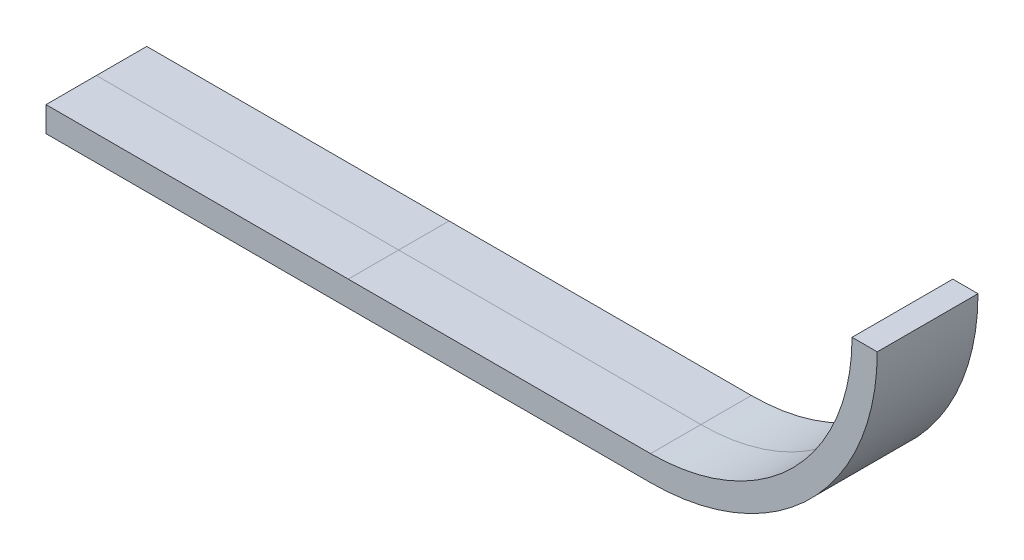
ISO-10303-21;
HEADER;
FILE_DESCRIPTION(('STEP AP214'),'2;1');
FILE_NAME('part.step','',(''),(''),'','','');
FILE_SCHEMA(('AUTOMOTIVE_DESIGN { 1 0 10303 214 1 1 1 1 }'));
ENDSEC;
DATA;
#1=APPLICATION_CONTEXT('core data for automotive mechanical design processes');
#2=APPLICATION_PROTOCOL_DEFINITION('international standard','automotive_design',2000,#1);
#3=PRODUCT_CONTEXT('',#1,'mechanical');
#4=PRODUCT('Part','Part','',(#3));
#5=PRODUCT_RELATED_PRODUCT_CATEGORY('part','',(#4));
#6=PRODUCT_DEFINITION_FORMATION('','',#4);
#7=PRODUCT_DEFINITION_CONTEXT('part definition',#1,'design');
#8=PRODUCT_DEFINITION('design','',#6,#7);
#9=PRODUCT_DEFINITION_SHAPE('','',#8);
#10=(LENGTH_UNIT() NAMED_UNIT(*) SI_UNIT(.MILLI.,.METRE.));
#11=(NAMED_UNIT(*) PLANE_ANGLE_UNIT() SI_UNIT($,.RADIAN.));
#12=(NAMED_UNIT(*) SI_UNIT($,.STERADIAN.) SOLID_ANGLE_UNIT());
#13=UNCERTAINTY_MEASURE_WITH_UNIT(LENGTH_MEASURE(1.E-05),#10,'distance_accuracy_value','');
#14=(GEOMETRIC_REPRESENTATION_CONTEXT(3) GLOBAL_UNCERTAINTY_ASSIGNED_CONTEXT((#13)) GLOBAL_UNIT_ASSIGNED_CONTEXT((#10,
#11,#12)) REPRESENTATION_CONTEXT('',''));
#15=CARTESIAN_POINT('',(0.,0.,0.));
#16=DIRECTION('',(0.,0.,1.));
#17=DIRECTION('',(1.,0.,0.));
#18=AXIS2_PLACEMENT_3D('',#15,#16,#17);
#19=CARTESIAN_POINT('',(38.1,28.575,12.7));
#20=DIRECTION('',(0.,0.,-1.));
#21=DIRECTION('',(-1.,0.,0.));
#22=AXIS2_PLACEMENT_3D('',#19,#20,#21);
#23=CYLINDRICAL_SURFACE('',#22,25.4);
#24=DIRECTION('',(0.,0.,-1.));
#25=VECTOR('',#24,1.);
#26=CARTESIAN_POINT('',(56.0605178,10.6144933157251,12.7));
#27=LINE('',#26,#25);
#28=CARTESIAN_POINT('',(56.0605178,10.6144933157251,12.7));
#29=VERTEX_POINT('',#28);
#30=CARTESIAN_POINT('',(56.0605178,10.6144933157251,6.35));
#31=VERTEX_POINT('',#30);
#32=EDGE_CURVE('E11',#29,#31,#27,.T.);
#33=ORIENTED_EDGE('',*,*,#32,.F.);
#34=CARTESIAN_POINT('',(38.1,28.575,12.7));
#35=DIRECTION('',(0.,0.,-1.));
#36=DIRECTION('',(1.,0.,0.));
#37=AXIS2_PLACEMENT_3D('',#34,#35,#36);
#38=CIRCLE('',#37,25.4);
#39=CARTESIAN_POINT('',(63.5,28.575,12.7));
#40=VERTEX_POINT('',#39);
#41=EDGE_CURVE('E122',#40,#29,#38,.T.);
#42=ORIENTED_EDGE('',*,*,#41,.F.);
#43=DIRECTION('',(0.,0.,-1.));
#44=VECTOR('',#43,1.);
#45=CARTESIAN_POINT('',(63.5,28.575,12.7));
#46=LINE('',#45,#44);
#47=CARTESIAN_POINT('',(63.5,28.575,6.35));
#48=VERTEX_POINT('',#47);
#49=EDGE_CURVE('E192',#40,#48,#46,.T.);
#50=ORIENTED_EDGE('',*,*,#49,.T.);
#51=CARTESIAN_POINT('',(38.1,28.575,6.35));
#52=DIRECTION('',(0.,0.,1.));
#53=DIRECTION('',(1.,0.,0.));
#54=AXIS2_PLACEMENT_3D('',#51,#52,#53);
#55=CIRCLE('',#54,25.4);
#56=EDGE_CURVE('E150',#48,#31,#55,.F.);
#57=ORIENTED_EDGE('',*,*,#56,.T.);
#58=EDGE_LOOP('',(#33,#42,#50,#57));
#59=FACE_BOUND('',#58,.T.);
#60=ADVANCED_FACE('F38',(#59),#23,.F.);
#61=DIRECTION('',(0.,0.,-1.));
#62=VECTOR('',#61,1.);
#63=CARTESIAN_POINT('',(56.0605178,10.6144933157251,12.7));
#64=LINE('',#63,#62);
#65=CARTESIAN_POINT('',(56.0605178,10.6144933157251,0.));
#66=VERTEX_POINT('',#65);
#67=EDGE_CURVE('E42',#31,#66,#64,.T.);
#68=ORIENTED_EDGE('',*,*,#67,.F.);
#69=ORIENTED_EDGE('',*,*,#56,.F.);
#70=CARTESIAN_POINT('',(63.5,28.575,0.));
#71=VERTEX_POINT('',#70);
#72=EDGE_CURVE('E196',#48,#71,#46,.T.);
#73=ORIENTED_EDGE('',*,*,#72,.T.);
#74=CARTESIAN_POINT('',(38.1,28.575,0.));
#75=DIRECTION('',(0.,0.,-1.));
#76=DIRECTION('',(1.,0.,0.));
#77=AXIS2_PLACEMENT_3D('',#74,#75,#76);
#78=CIRCLE('',#77,25.4);
#79=EDGE_CURVE('E178',#71,#66,#78,.T.);
#80=ORIENTED_EDGE('',*,*,#79,.T.);
#81=EDGE_LOOP('',(#68,#69,#73,#80));
#82=FACE_BOUND('',#81,.T.);
#83=ADVANCED_FACE('F225',(#82),#23,.F.);
#84=CARTESIAN_POINT('',(38.1,3.175,12.7));
#85=DIRECTION('',(0.,-1.,0.));
#86=DIRECTION('',(1.,0.,0.));
#87=AXIS2_PLACEMENT_3D('',#84,#85,#86);
#88=PLANE('',#87);
#89=DIRECTION('',(0.,0.,-1.));
#90=VECTOR('',#89,1.);
#91=CARTESIAN_POINT('',(0.,3.175,12.7));
#92=LINE('',#91,#90);
#93=CARTESIAN_POINT('',(0.,3.175,12.7));
#94=VERTEX_POINT('',#93);
#95=CARTESIAN_POINT('',(0.,3.175,6.35));
#96=VERTEX_POINT('',#95);
#97=EDGE_CURVE('E132',#94,#96,#92,.T.);
#98=ORIENTED_EDGE('',*,*,#97,.F.);
#99=DIRECTION('',(-1.,0.,0.));
#100=VECTOR('',#99,1.);
#101=CARTESIAN_POINT('',(38.1,3.175,12.7));
#102=LINE('',#101,#100);
#103=CARTESIAN_POINT('',(38.1,3.175,12.7));
#104=VERTEX_POINT('',#103);
#105=EDGE_CURVE('E121',#104,#94,#102,.T.);
#106=ORIENTED_EDGE('',*,*,#105,.F.);
#107=DIRECTION('',(0.,0.,-1.));
#108=VECTOR('',#107,1.);
#109=CARTESIAN_POINT('',(38.1,3.175,12.7));
#110=LINE('',#109,#108);
#111=CARTESIAN_POINT('',(38.1,3.175,6.35));
#112=VERTEX_POINT('',#111);
#113=EDGE_CURVE('E131',#104,#112,#110,.T.);
#114=ORIENTED_EDGE('',*,*,#113,.T.);
#115=DIRECTION('',(-1.,0.,0.));
#116=VECTOR('',#115,1.);
#117=CARTESIAN_POINT('',(38.1,3.175,6.35));
#118=LINE('',#117,#116);
#119=EDGE_CURVE('E143',#112,#96,#118,.T.);
#120=ORIENTED_EDGE('',*,*,#119,.T.);
#121=EDGE_LOOP('',(#98,#106,#114,#120));
#122=FACE_BOUND('',#121,.T.);
#123=ADVANCED_FACE('F129',(#122),#88,.F.);
#124=DIRECTION('',(0.,0.,-1.));
#125=VECTOR('',#124,1.);
#126=CARTESIAN_POINT('',(0.,3.175,12.7));
#127=LINE('',#126,#125);
#128=CARTESIAN_POINT('',(0.,3.175,0.));
#129=VERTEX_POINT('',#128);
#130=EDGE_CURVE('E152',#96,#129,#127,.T.);
#131=ORIENTED_EDGE('',*,*,#130,.F.);
#132=ORIENTED_EDGE('',*,*,#119,.F.);
#133=CARTESIAN_POINT('',(38.1,3.175,0.));
#134=VERTEX_POINT('',#133);
#135=EDGE_CURVE('E140',#112,#134,#110,.T.);
#136=ORIENTED_EDGE('',*,*,#135,.T.);
#137=DIRECTION('',(-1.,0.,0.));
#138=VECTOR('',#137,1.);
#139=CARTESIAN_POINT('',(38.1,3.175,0.));
#140=LINE('',#139,#138);
#141=EDGE_CURVE('E175',#134,#129,#140,.T.);
#142=ORIENTED_EDGE('',*,*,#141,.T.);
#143=EDGE_LOOP('',(#131,#132,#136,#142));
#144=FACE_BOUND('',#143,.T.);
#145=ADVANCED_FACE('F180',(#144),#88,.F.);
#146=EDGE_CURVE('E137',#31,#112,#55,.F.);
#147=ORIENTED_EDGE('',*,*,#146,.F.);
#148=ORIENTED_EDGE('',*,*,#67,.T.);
#149=EDGE_CURVE('E231',#66,#134,#78,.T.);
#150=ORIENTED_EDGE('',*,*,#149,.T.);
#151=ORIENTED_EDGE('',*,*,#135,.F.);
#152=EDGE_LOOP('',(#147,#148,#150,#151));
#153=FACE_BOUND('',#152,.T.);
#154=ADVANCED_FACE('F232',(#153),#23,.F.);
#155=CARTESIAN_POINT('',(-38.1,3.17499999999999,6.35));
#156=VERTEX_POINT('',#155);
#157=EDGE_CURVE('E139',#96,#156,#118,.T.);
#158=ORIENTED_EDGE('',*,*,#157,.F.);
#159=ORIENTED_EDGE('',*,*,#130,.T.);
#160=CARTESIAN_POINT('',(-38.1,3.17499999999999,0.));
#161=VERTEX_POINT('',#160);
#162=EDGE_CURVE('E166',#129,#161,#140,.T.);
#163=ORIENTED_EDGE('',*,*,#162,.T.);
#164=DIRECTION('',(0.,0.,-1.));
#165=VECTOR('',#164,1.);
#166=CARTESIAN_POINT('',(-38.1,3.17499999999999,12.7));
#167=LINE('',#166,#165);
#168=EDGE_CURVE('E203',#156,#161,#167,.T.);
#169=ORIENTED_EDGE('',*,*,#168,.F.);
#170=EDGE_LOOP('',(#158,#159,#163,#169));
#171=FACE_BOUND('',#170,.T.);
#172=ADVANCED_FACE('F164',(#171),#88,.F.);
#173=EDGE_CURVE('E118',#29,#104,#38,.T.);
#174=ORIENTED_EDGE('',*,*,#173,.F.);
#175=ORIENTED_EDGE('',*,*,#32,.T.);
#176=ORIENTED_EDGE('',*,*,#146,.T.);
#177=ORIENTED_EDGE('',*,*,#113,.F.);
#178=EDGE_LOOP('',(#174,#175,#176,#177));
#179=FACE_BOUND('',#178,.T.);
#180=ADVANCED_FACE('F40',(#179),#23,.F.);
#181=CARTESIAN_POINT('',(-38.1,3.17499999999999,12.7));
#182=VERTEX_POINT('',#181);
#183=EDGE_CURVE('E135',#94,#182,#102,.T.);
#184=ORIENTED_EDGE('',*,*,#183,.F.);
#185=ORIENTED_EDGE('',*,*,#97,.T.);
#186=ORIENTED_EDGE('',*,*,#157,.T.);
#187=EDGE_CURVE('E146',#182,#156,#167,.T.);
#188=ORIENTED_EDGE('',*,*,#187,.F.);
#189=EDGE_LOOP('',(#184,#185,#186,#188));
#190=FACE_BOUND('',#189,.T.);
#191=ADVANCED_FACE('F213',(#190),#88,.F.);
#192=CARTESIAN_POINT('',(-38.1,3.17499999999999,12.7));
#193=DIRECTION('',(1.,0.,0.));
#194=DIRECTION('',(0.,1.,0.));
#195=AXIS2_PLACEMENT_3D('',#192,#193,#194);
#196=PLANE('',#195);
#197=DIRECTION('',(0.,-1.,0.));
#198=VECTOR('',#197,1.);
#199=CARTESIAN_POINT('',(-38.1,3.17499999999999,0.));
#200=LINE('',#199,#198);
#201=CARTESIAN_POINT('',(-38.1,0.,0.));
#202=VERTEX_POINT('',#201);
#203=EDGE_CURVE('E177',#161,#202,#200,.T.);
#204=ORIENTED_EDGE('',*,*,#203,.T.);
#205=DIRECTION('',(0.,0.,-1.));
#206=VECTOR('',#205,1.);
#207=CARTESIAN_POINT('',(-38.1,0.,12.7));
#208=LINE('',#207,#206);
#209=CARTESIAN_POINT('',(-38.1,0.,12.7));
#210=VERTEX_POINT('',#209);
#211=EDGE_CURVE('E201',#210,#202,#208,.T.);
#212=ORIENTED_EDGE('',*,*,#211,.F.);
#213=DIRECTION('',(0.,-1.,0.));
#214=VECTOR('',#213,1.);
#215=CARTESIAN_POINT('',(-38.1,3.17499999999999,12.7));
#216=LINE('',#215,#214);
#217=EDGE_CURVE('E134',#182,#210,#216,.T.);
#218=ORIENTED_EDGE('',*,*,#217,.F.);
#219=ORIENTED_EDGE('',*,*,#187,.T.);
#220=ORIENTED_EDGE('',*,*,#168,.T.);
#221=EDGE_LOOP('',(#204,#212,#218,#219,#220));
#222=FACE_BOUND('',#221,.T.);
#223=ADVANCED_FACE('F211',(#222),#196,.F.);
#224=CARTESIAN_POINT('',(38.1,0.,12.7));
#225=DIRECTION('',(0.,1.,0.));
#226=DIRECTION('',(-1.,0.,0.));
#227=AXIS2_PLACEMENT_3D('',#224,#225,#226);
#228=PLANE('',#227);
#229=DIRECTION('',(1.,0.,0.));
#230=VECTOR('',#229,1.);
#231=CARTESIAN_POINT('',(38.1,0.,0.));
#232=LINE('',#231,#230);
#233=CARTESIAN_POINT('',(38.1,0.,0.));
#234=VERTEX_POINT('',#233);
#235=EDGE_CURVE('E182',#202,#234,#232,.T.);
#236=ORIENTED_EDGE('',*,*,#235,.T.);
#237=DIRECTION('',(0.,0.,-1.));
#238=VECTOR('',#237,1.);
#239=CARTESIAN_POINT('',(38.1,0.,12.7));
#240=LINE('',#239,#238);
#241=CARTESIAN_POINT('',(38.1,0.,12.7));
#242=VERTEX_POINT('',#241);
#243=EDGE_CURVE('E199',#242,#234,#240,.T.);
#244=ORIENTED_EDGE('',*,*,#243,.F.);
#245=DIRECTION('',(1.,0.,0.));
#246=VECTOR('',#245,1.);
#247=CARTESIAN_POINT('',(38.1,0.,12.7));
#248=LINE('',#247,#246);
#249=EDGE_CURVE('E216',#210,#242,#248,.T.);
#250=ORIENTED_EDGE('',*,*,#249,.F.);
#251=ORIENTED_EDGE('',*,*,#211,.T.);
#252=EDGE_LOOP('',(#236,#244,#250,#251));
#253=FACE_BOUND('',#252,.T.);
#254=ADVANCED_FACE('F253',(#253),#228,.F.);
#255=CARTESIAN_POINT('',(38.1,28.575,12.7));
#256=DIRECTION('',(0.,0.,-1.));
#257=DIRECTION('',(-1.,0.,0.));
#258=AXIS2_PLACEMENT_3D('',#255,#256,#257);
#259=CYLINDRICAL_SURFACE('',#258,28.575);
#260=CARTESIAN_POINT('',(38.1,28.575,0.));
#261=DIRECTION('',(0.,0.,1.));
#262=DIRECTION('',(1.,0.,0.));
#263=AXIS2_PLACEMENT_3D('',#260,#261,#262);
#264=CIRCLE('',#263,28.575);
#265=CARTESIAN_POINT('',(66.675,28.575,0.));
#266=VERTEX_POINT('',#265);
#267=EDGE_CURVE('E188',#234,#266,#264,.T.);
#268=ORIENTED_EDGE('',*,*,#267,.T.);
#269=DIRECTION('',(0.,0.,-1.));
#270=VECTOR('',#269,1.);
#271=CARTESIAN_POINT('',(66.675,28.575,12.7));
#272=LINE('',#271,#270);
#273=CARTESIAN_POINT('',(66.675,28.575,12.7));
#274=VERTEX_POINT('',#273);
#275=EDGE_CURVE('E195',#274,#266,#272,.T.);
#276=ORIENTED_EDGE('',*,*,#275,.F.);
#277=CARTESIAN_POINT('',(38.1,28.575,12.7));
#278=DIRECTION('',(0.,0.,1.));
#279=DIRECTION('',(1.,0.,0.));
#280=AXIS2_PLACEMENT_3D('',#277,#278,#279);
#281=CIRCLE('',#280,28.575);
#282=EDGE_CURVE('E218',#242,#274,#281,.T.);
#283=ORIENTED_EDGE('',*,*,#282,.F.);
#284=ORIENTED_EDGE('',*,*,#243,.T.);
#285=EDGE_LOOP('',(#268,#276,#283,#284));
#286=FACE_BOUND('',#285,.T.);
#287=ADVANCED_FACE('F256',(#286),#259,.T.);
#288=CARTESIAN_POINT('',(63.5,28.575,12.7));
#289=DIRECTION('',(0.,-1.,0.));
#290=DIRECTION('',(1.,0.,0.));
#291=AXIS2_PLACEMENT_3D('',#288,#289,#290);
#292=PLANE('',#291);
#293=DIRECTION('',(-1.,0.,0.));
#294=VECTOR('',#293,1.);
#295=CARTESIAN_POINT('',(63.5,28.575,0.));
#296=LINE('',#295,#294);
#297=EDGE_CURVE('E125',#266,#71,#296,.T.);
#298=ORIENTED_EDGE('',*,*,#297,.T.);
#299=ORIENTED_EDGE('',*,*,#72,.F.);
#300=ORIENTED_EDGE('',*,*,#49,.F.);
#301=DIRECTION('',(-1.,0.,0.));
#302=VECTOR('',#301,1.);
#303=CARTESIAN_POINT('',(63.5,28.575,12.7));
#304=LINE('',#303,#302);
#305=EDGE_CURVE('E219',#274,#40,#304,.T.);
#306=ORIENTED_EDGE('',*,*,#305,.F.);
#307=ORIENTED_EDGE('',*,*,#275,.T.);
#308=EDGE_LOOP('',(#298,#299,#300,#306,#307));
#309=FACE_BOUND('',#308,.T.);
#310=ADVANCED_FACE('F228',(#309),#292,.F.);
#311=CARTESIAN_POINT('',(38.1,28.575,12.7));
#312=DIRECTION('',(0.,0.,1.));
#313=DIRECTION('',(1.,0.,0.));
#314=AXIS2_PLACEMENT_3D('',#311,#312,#313);
#315=PLANE('',#314);
#316=ORIENTED_EDGE('',*,*,#41,.T.);
#317=ORIENTED_EDGE('',*,*,#173,.T.);
#318=ORIENTED_EDGE('',*,*,#105,.T.);
#319=ORIENTED_EDGE('',*,*,#183,.T.);
#320=ORIENTED_EDGE('',*,*,#217,.T.);
#321=ORIENTED_EDGE('',*,*,#249,.T.);
#322=ORIENTED_EDGE('',*,*,#282,.T.);
#323=ORIENTED_EDGE('',*,*,#305,.T.);
#324=EDGE_LOOP('',(#316,#317,#318,#319,#320,#321,#322,#323));
#325=FACE_BOUND('',#324,.T.);
#326=ADVANCED_FACE('F120',(#325),#315,.T.);
#327=CARTESIAN_POINT('',(38.1,28.575,0.));
#328=DIRECTION('',(0.,0.,1.));
#329=DIRECTION('',(1.,0.,0.));
#330=AXIS2_PLACEMENT_3D('',#327,#328,#329);
#331=PLANE('',#330);
#332=ORIENTED_EDGE('',*,*,#79,.F.);
#333=ORIENTED_EDGE('',*,*,#297,.F.);
#334=ORIENTED_EDGE('',*,*,#267,.F.);
#335=ORIENTED_EDGE('',*,*,#235,.F.);
#336=ORIENTED_EDGE('',*,*,#203,.F.);
#337=ORIENTED_EDGE('',*,*,#162,.F.);
#338=ORIENTED_EDGE('',*,*,#141,.F.);
#339=ORIENTED_EDGE('',*,*,#149,.F.);
#340=EDGE_LOOP('',(#332,#333,#334,#335,#336,#337,#338,#339));
#341=FACE_BOUND('',#340,.T.);
#342=ADVANCED_FACE('F174',(#341),#331,.F.);
#343=CLOSED_SHELL('',(#60,#83,#123,#145,#154,#172,#180,#191,#223,#254,#287,#310,#326,#342));
#344=MANIFOLD_SOLID_BREP('B2',#343);
#345=ADVANCED_BREP_SHAPE_REPRESENTATION('',(#18,#344),#14);
#346=SHAPE_DEFINITION_REPRESENTATION(#9,#345);
ENDSEC;
END-ISO-10303-21;
